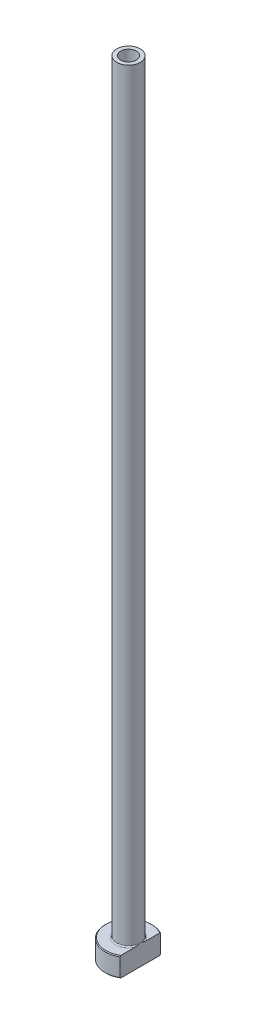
from build123d import *

# Parameters (mm, degrees)
FILLET1_R          = 0.3
CHAMFER1_SIZE      = 0.2
CUT_EXTRUDE1_DEPTH = 201.179919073
CHAMFER2_SIZE      = 0.5


with BuildPart() as part:
    # Sketch1 → Revolve1 (revolve)
    with BuildSketch(Plane.XY, mode=Mode.PRIVATE) as revolve1_sk:
        Polygon((-2, 200), (-3, 200), (-3, 5), (-6, 5), (-6, 0), (-2.25, 0), (-2.25, 143), (-2, 155), align=None)
    revolve(revolve1_sk.sketch.rotate(Axis((0, 92.187680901, 0), (0, -1, 0)), 270), axis=Axis((0, 92.187680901, 0), (0, -1, 0)))

    # Fillet1
    fillet1_edges = [part.edges().sort_by_distance(p)[0] for p in [
        (0, 5, -3),
    ]]
    fillet(fillet1_edges, radius=FILLET1_R)

    # Chamfer1
    chamfer1_edges = [part.edges().sort_by_distance(p)[0] for p in [
        (0, 0, -6),
        (0, 5, -6),
    ]]
    chamfer(chamfer1_edges, length=CHAMFER1_SIZE)

    # Sketch2 → Cut-Extrude1 (cut, through all)
    with BuildSketch(Plane.XZ):
        with BuildLine():
            Line((3, 5.196152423), (3, -5.196152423))
            ThreePointArc((3, -5.196152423), (6, 0), (3, 5.196152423))
        make_face()
    extrude(amount=-CUT_EXTRUDE1_DEPTH, mode=Mode.SUBTRACT)

    # Chamfer2
    chamfer2_edges = [part.edges().sort_by_distance(p)[0] for p in [
        (0, 0, -2.25),
    ]]
    chamfer(chamfer2_edges, length=CHAMFER2_SIZE)


solid = part.part
